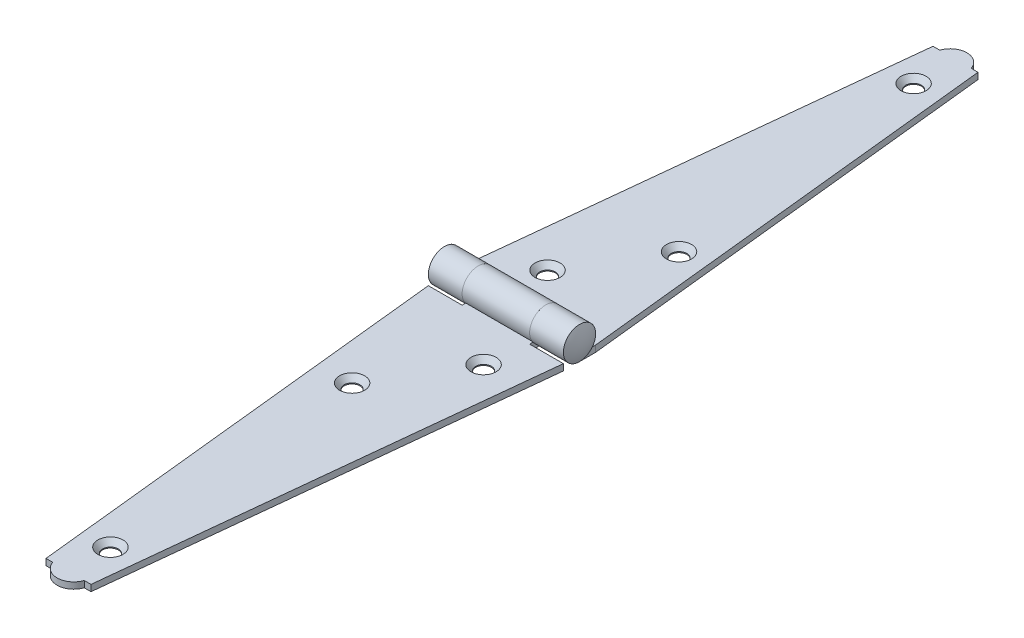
from build123d import *
from OCP.BRepFilletAPI import BRepFilletAPI_MakeChamfer

# Parameters (mm, degrees)
EXTRUDE1_DEPTH             = 15.08125
SKETCH3_W                  = 7.540625
SKETCH3_H                  = 7.210425
CUT_EXTRUDE1_DEPTH         = 103.965986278
EXTRUDE2_REACH             = 104.966
EXTRUDE2_DIRECTION_2_REACH = 104.966
SKETCH6_W                  = 15.08125
SKETCH6_H                  = 7.210425
CUT_EXTRUDE3_DEPTH         = 103.965986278
CUT_EXTRUDE4_DEPTH         = 1056.132
SKETCH9_R                  = 1.7526
EXTRUDE6_DEPTH             = 103.99062969
CHAMFER1_SIZE              = 1.20904
CHAMFER1_SIZE2             = 1.051002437
CHAMFER2_SIZE              = 1.20904
CHAMFER2_SIZE2             = 1.051002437


with BuildPart() as part:
    # Sketch2 → Extrude1 (new, symmetric)
    with BuildSketch(Plane(origin=(0, 0, 0), x_dir=(0, 0, -1), z_dir=(1, 0, 0))):
        with BuildLine():
            Line((0, 0), (-101.6, 0))
            Line((-101.6, 0), (-101.6, 1.4224))
            Line((-101.6, 1.4224), (0, 1.4224))
            ThreePointArc((0, 1.4224), (1.052506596, 5.517514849), (-1.844144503, 2.437393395))
            Line((-1.844144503, 2.437393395), (-3.045856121, 1.6764))
            ThreePointArc((-3.045856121, 1.6764), (1.738358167, 6.763640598), (0, 0))
        make_face()
    extrude(amount=EXTRUDE1_DEPTH, both=True)

    # Sketch3 → Cut-Extrude1 (cut, through all)
    with BuildSketch(Plane(origin=(0, 0, 0), x_dir=(1, 0, 0), z_dir=(0, 1, 0))):
        with Locations((11.3109375, 0)):
            Rectangle(SKETCH3_W, SKETCH3_H)
        with Locations((-11.3109375, 0)):
            Rectangle(SKETCH3_W, SKETCH3_H)
    extrude(amount=CUT_EXTRUDE1_DEPTH, mode=Mode.SUBTRACT)


with BuildPart() as body_2:

    # Extrude2: up to this face of the body (flat: up to its plane)
    extrude2_end = Plane(part.part.faces().sort_by_distance((15.08125, 0.7112, 52.60260625))[0])
    # Sketch4 → Extrude2 (new, up to the picked face)
    with BuildSketch(Plane(origin=(0, 0, 0), x_dir=(0, 0, -1), z_dir=(1, 0, 0)), mode=Mode.PRIVATE) as extrude2_sk1:
        with BuildLine():
            Line((0, 0), (101.6, 0))
            Line((101.6, 0), (101.6, 1.4224))
            Line((101.6, 1.4224), (0, 1.4224))
            ThreePointArc((0, 1.4224), (-1.052506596, 5.517514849), (1.844144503, 2.437393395))
            Line((1.844144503, 2.437393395), (3.045856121, 1.6764))
            ThreePointArc((3.045856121, 1.6764), (-1.738358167, 6.763640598), (0, 0))
        make_face()
    extrude2_tool1 = split(extrude(extrude2_sk1.sketch, amount=EXTRUDE2_REACH, mode=Mode.PRIVATE), bisect_by=extrude2_end, keep=Keep.BOTH, mode=Mode.PRIVATE)
    add(extrude2_tool1.solids().sort_by(Axis((0, 1.151119, -44.128041), (1, 0, 0)))[0])


    # Extrude2 direction 2: up to this face of the body (flat: up to its plane)
    extrude2_direction_2_end = Plane(part.part.faces().sort_by_distance((-15.08125, 0.7112, 52.60260625))[0])
    # Sketch4 → Extrude2 direction 2 (add, up to the picked face)
    with BuildSketch(Plane(origin=(0, 0, 0), x_dir=(0, 0, -1), z_dir=(1, 0, 0)), mode=Mode.PRIVATE) as extrude2_direction_2_sk1:
        with BuildLine():
            Line((0, 0), (101.6, 0))
            Line((101.6, 0), (101.6, 1.4224))
            Line((101.6, 1.4224), (0, 1.4224))
            ThreePointArc((0, 1.4224), (-1.052506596, 5.517514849), (1.844144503, 2.437393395))
            Line((1.844144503, 2.437393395), (3.045856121, 1.6764))
            ThreePointArc((3.045856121, 1.6764), (-1.738358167, 6.763640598), (0, 0))
        make_face()
    extrude2_direction_2_tool1 = split(extrude(extrude2_direction_2_sk1.sketch, amount=-EXTRUDE2_DIRECTION_2_REACH, mode=Mode.PRIVATE), bisect_by=extrude2_direction_2_end, keep=Keep.BOTH, mode=Mode.PRIVATE)
    add(extrude2_direction_2_tool1.solids().sort_by(Axis((0, 1.151119, -44.128041), (-1, 0, 0)))[0])

    # Sketch6 → Cut-Extrude3 (cut, through all)
    with BuildSketch(Plane(origin=(0, 0, 0), x_dir=(1, 0, 0), z_dir=(0, 1, 0))):
        Rectangle(SKETCH6_W, SKETCH6_H)
    extrude(amount=CUT_EXTRUDE3_DEPTH, mode=Mode.SUBTRACT)


with BuildPart() as body_3:
    # Sketch7 → Revolve1 (revolve)
    with BuildSketch(Plane(origin=(0, 3.6052125, 0), x_dir=(-1, 0, 0), z_dir=(0, 1, 0))):
        with BuildLine():
            Line((-15.84325, 0), (15.84325, 0))
            ThreePointArc((15.84325, 0), (15.650668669, -1.842430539), (15.08125, -3.6052125))
            Line((15.08125, -3.6052125), (15.08125, -2.1828125))
            Line((15.08125, -2.1828125), (-15.08125, -2.1828125))
            Line((-15.08125, -2.1828125), (-15.08125, -3.6052125))
            ThreePointArc((-15.08125, -3.6052125), (-15.650668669, -1.842430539), (-15.84325, 0))
        make_face()
    revolve(axis=Axis((15.84325, 3.6052125, 0), (-1, 0, 0)))


with BuildPart() as cut_extrude4_tool:
    # Sketch8 → Cut-Extrude4 (new body)
    with BuildSketch(Plane(origin=(0, 1.4224, 0), x_dir=(-1, 0, 0), z_dir=(0, 1, 0))):
        with BuildLine():
            Line((-3.518958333, -99.06), (-5.027083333, -99.06))
            Line((-5.027083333, -99.06), (-15.08125, -3.6052125))
            Line((-15.08125, -3.6052125), (-40.48125, -3.6052125))
            Line((-40.48125, -3.6052125), (-40.48125, -126.985688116))
            Line((-40.48125, -126.985688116), (40.48125, -126.985688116))
            Line((40.48125, -126.985688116), (40.48125, -3.6052125))
            Line((40.48125, -3.6052125), (15.08125, -3.6052125))
            Line((15.08125, -3.6052125), (5.027083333, -99.06))
            Line((5.027083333, -99.06), (3.518958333, -99.06))
            ThreePointArc((3.518958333, -99.06), (0, -101.6), (-3.518958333, -99.06))
        make_face()
        with BuildLine():
            Line((-3.518958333, 99.06), (-5.027083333, 99.06))
            Line((-5.027083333, 99.06), (-15.08125, 3.6052125))
            Line((-15.08125, 3.6052125), (-40.48125, 3.6052125))
            Line((-40.48125, 3.6052125), (-40.48125, 126.985688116))
            Line((-40.48125, 126.985688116), (40.48125, 126.985688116))
            Line((40.48125, 126.985688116), (40.48125, 3.6052125))
            Line((40.48125, 3.6052125), (15.08125, 3.6052125))
            Line((15.08125, 3.6052125), (5.027083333, 99.06))
            Line((5.027083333, 99.06), (3.518958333, 99.06))
            ThreePointArc((3.518958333, 99.06), (0, 101.6), (-3.518958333, 99.06))
        make_face()
    extrude(amount=-CUT_EXTRUDE4_DEPTH)


with BuildPart() as part_1:
    add(part.part)

    # Cut-Extrude4: cut by cut_extrude4_tool
    add(cut_extrude4_tool.part, mode=Mode.SUBTRACT)


with BuildPart() as body_2_1:
    add(body_2.part)

    # Cut-Extrude4: cut by cut_extrude4_tool
    add(cut_extrude4_tool.part, mode=Mode.SUBTRACT)


with BuildPart() as extrude6_tool:
    # Sketch9 → Extrude6 (new, through all)
    with BuildSketch(Plane(origin=(0, 1.4224, 0), x_dir=(-1, 0, 0), z_dir=(0, 1, 0))):
        with Locations(Location((0, -89.69375, 0), (0, 0, 90))):
            Circle(SKETCH9_R)
        with Locations(Location((-6.35, -30.95625, 0), (0, 0, 90))):
            Circle(SKETCH9_R)
        with Locations(Location((4.7625, -12.7, 0), (0, 0, 90))):
            Circle(SKETCH9_R)
        with Locations(Location((-6.35, 12.7, 0), (0, 0, 90))):
            Circle(SKETCH9_R)
        with Locations(Location((4.7625, 30.95625, 0), (0, 0, 90))):
            Circle(SKETCH9_R)
        with Locations(Location((0, 89.69375, 0), (0, 0, 90))):
            Circle(SKETCH9_R)
    extrude(amount=-EXTRUDE6_DEPTH)


with BuildPart() as part_2:
    add(part_1.part)

    # Extrude6: cut by extrude6_tool
    add(extrude6_tool.part, mode=Mode.SUBTRACT)

    # Chamfer1: one chamfer whose edges measure the first distance from different faces: ONE call of the kernel's chamfer builder (chamfer() names one face for all edges)
    chamfer1_edges_1 = [part_2.edges().sort_by_distance(p)[0] for p in [
        (6.35, 1.4224, 10.9474),
    ]]
    chamfer1_side_1 = [part_2.faces().sort_by_distance(p)[0] for p in [
        (6.35, 0.7112, 10.9474),
    ]]
    chamfer1_edges_2 = [part_2.edges().sort_by_distance(p)[0] for p in [
        (-4.7625, 1.4224, 29.20365),
    ]]
    chamfer1_side_2 = [part_2.faces().sort_by_distance(p)[0] for p in [
        (-4.7625, 0.7112, 29.20365),
    ]]
    chamfer1_edges_3 = [part_2.edges().sort_by_distance(p)[0] for p in [
        (0, 1.4224, 87.94115),
    ]]
    chamfer1_side_3 = [part_2.faces().sort_by_distance(p)[0] for p in [
        (0, 0.7112, 87.94115),
    ]]
    chamfer1 = BRepFilletAPI_MakeChamfer(part_2.part.solid().wrapped)
    for e in chamfer1_edges_1:
        chamfer1.Add(CHAMFER1_SIZE, CHAMFER1_SIZE2, e.wrapped, chamfer1_side_1[0].wrapped)  # the first distance lies on this face
    for e in chamfer1_edges_2:
        chamfer1.Add(CHAMFER1_SIZE, CHAMFER1_SIZE2, e.wrapped, chamfer1_side_2[0].wrapped)  # the first distance lies on this face
    for e in chamfer1_edges_3:
        chamfer1.Add(CHAMFER1_SIZE, CHAMFER1_SIZE2, e.wrapped, chamfer1_side_3[0].wrapped)  # the first distance lies on this face
    add(Compound.cast(chamfer1.Shape()), mode=Mode.REPLACE)


with BuildPart() as body_2_2:
    add(body_2_1.part)

    # Extrude6: cut by extrude6_tool
    add(extrude6_tool.part, mode=Mode.SUBTRACT)

    # Chamfer2: one chamfer whose edges measure the first distance from different faces: ONE call of the kernel's chamfer builder (chamfer() names one face for all edges)
    chamfer2_edges_1 = [body_2_2.edges().sort_by_distance(p)[0] for p in [
        (0, 1.4224, -91.44635),
    ]]
    chamfer2_side_1 = [body_2_2.faces().sort_by_distance(p)[0] for p in [
        (0, 0.7112, -91.44635),
    ]]
    chamfer2_edges_2 = [body_2_2.edges().sort_by_distance(p)[0] for p in [
        (6.35, 1.4224, -32.70885),
    ]]
    chamfer2_side_2 = [body_2_2.faces().sort_by_distance(p)[0] for p in [
        (6.35, 0.7112, -32.70885),
    ]]
    chamfer2_edges_3 = [body_2_2.edges().sort_by_distance(p)[0] for p in [
        (-4.7625, 1.4224, -14.4526),
    ]]
    chamfer2_side_3 = [body_2_2.faces().sort_by_distance(p)[0] for p in [
        (-4.7625, 0.7112, -14.4526),
    ]]
    chamfer2 = BRepFilletAPI_MakeChamfer(body_2_2.part.solid().wrapped)
    for e in chamfer2_edges_1:
        chamfer2.Add(CHAMFER2_SIZE, CHAMFER2_SIZE2, e.wrapped, chamfer2_side_1[0].wrapped)  # the first distance lies on this face
    for e in chamfer2_edges_2:
        chamfer2.Add(CHAMFER2_SIZE, CHAMFER2_SIZE2, e.wrapped, chamfer2_side_2[0].wrapped)  # the first distance lies on this face
    for e in chamfer2_edges_3:
        chamfer2.Add(CHAMFER2_SIZE, CHAMFER2_SIZE2, e.wrapped, chamfer2_side_3[0].wrapped)  # the first distance lies on this face
    add(Compound.cast(chamfer2.Shape()), mode=Mode.REPLACE)


solid = Compound([body_3.part, part_2.part, body_2_2.part])
